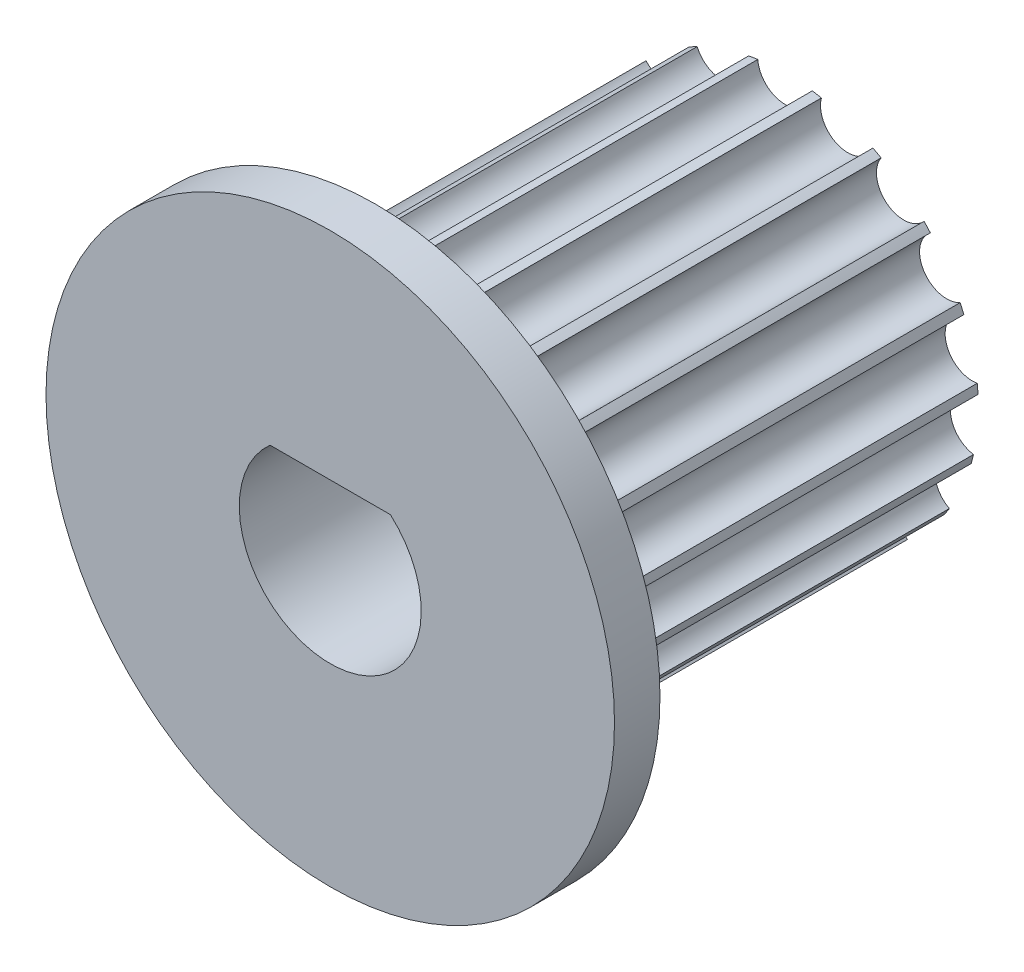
from build123d import *

# Parameters (mm, degrees)
ENL_V_MAT_EXTRU_1_DEPTH      = 27.69269563
ENL_V_MAT_EXTRU_3_DEPTH      = 17
R_P_TITION_CIRCULAIRE1_COUNT = 19


with BuildPart() as part:
    # Esquisse1 → R_volution2 (revolve)
    with BuildSketch(Plane(origin=(0, 0, 0), x_dir=(0, 0, -1), z_dir=(1, 0, 0)), mode=Mode.PRIVATE) as r_volution2_sk:
        Polygon((0, 0), (0, 12.5), (2, 12.5), (2, 8.5), (20, 8.5), (20, 0), align=None)
    revolve(r_volution2_sk.sketch.rotate(Axis((0, 0, 28.664689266), (0, 0, -1)), 90), axis=Axis((0, 0, 28.664689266), (0, 0, -1)))

    # Esquisse2 → Enl_v. mat.-Extru.1 (cut, through all)
    with BuildSketch(Plane(origin=(0, 0, -20), x_dir=(-1, 0, 0), z_dir=(0, 0, -1))):
        with BuildLine():
            Line((-2.645751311, 3), (2.645751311, 3))
            ThreePointArc((2.645751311, 3), (0, -4), (-2.645751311, 3))
        make_face()
    extrude(amount=-ENL_V_MAT_EXTRU_1_DEPTH, mode=Mode.SUBTRACT)

    # Esquisse3 → Enl_v. mat.-Extru.3 (cut)
    with BuildSketch(Plane(origin=(0, 0, -20), x_dir=(-1, 0, 0), z_dir=(0, 0, -1))):
        with BuildLine():
            Line((-1.2, 8.5), (-1.2, 9.75))
            Line((-1.2, 9.75), (1.2, 9.75))
            Line((1.2, 9.75), (1.2, 8.5))
            ThreePointArc((1.2, 8.5), (0, 7.3), (-1.2, 8.5))
        make_face()
    enl_v_mat_extru_3 = extrude(amount=-ENL_V_MAT_EXTRU_3_DEPTH, mode=Mode.SUBTRACT)

    # R_p_tition circulaire1: Enl_v. mat.-Extru.3 ×19 about axis
    r_p_tition_circulaire1_axis = Axis((0, 0, 0), (0, 0, 1))
    for i in range(1, R_P_TITION_CIRCULAIRE1_COUNT):
        add(enl_v_mat_extru_3.rotate(r_p_tition_circulaire1_axis, i * 360 / R_P_TITION_CIRCULAIRE1_COUNT), mode=Mode.SUBTRACT)


solid = part.part
